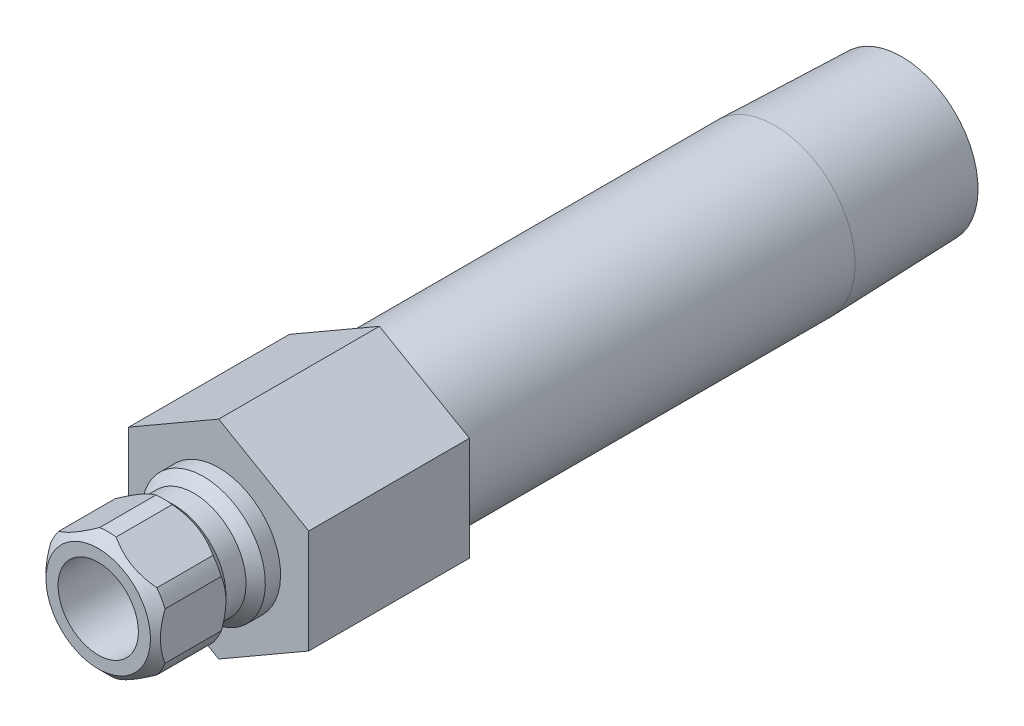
from build123d import *

# Parameters (mm, degrees)
SKETCH2_R           = 3.175
BOSS_EXTRUDE1_DEPTH = 12.7
CUT_EXTRUDE1_START  = 3.556
SKETCH3_OUTSIDE_W   = 29.646
SKETCH3_OUTSIDE_H   = 31.846
CUT_EXTRUDE1_DEPTH  = 52.501441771


with BuildPart() as part:
    # Sketch1 → Revolve1 (revolve)
    with BuildSketch(Plane(origin=(0, 0, 0), x_dir=(0, 0, -1), z_dir=(1, 0, 0))):
        Polygon((-9.525, 3.175), (-9.525, 4.1275), (-8.763, 4.8895), (-4.318, 4.8895), (-3.556, 4.1275), (-1.9685, 4.1275), (-1.2065, 4.8895), (0, 4.8895), (0, 6.35), (43.942, 6.35), (53.975, 6.036470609), (53.975, 4.6228), (12.7, 4.6228), (12.7, 3.175), align=None)
    revolve(axis=Axis((0, 0, 0), (0, 0, 1)))

    # Sketch2 → Boss-Extrude1 (add)
    with BuildSketch(Plane.XY):
        Polygon((-7.112, 4.106115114), (-7.112, -4.106115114), (0, -8.212230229), (7.112, -4.106115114), (7.112, 4.106115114), (0, 8.212230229), align=None)
        with Locations(Location((0, 0, 0), (0, 0, 90))):
            Circle(SKETCH2_R, mode=Mode.SUBTRACT)
    extrude(amount=-BOSS_EXTRUDE1_DEPTH)

    # Sketch3 outside → Cut-Extrude1 (cut, through all)
    with BuildSketch(Plane.XY.offset(CUT_EXTRUDE1_START)):
        Rectangle(SKETCH3_OUTSIDE_W, SKETCH3_OUTSIDE_H)
        Polygon((4.5212, -2.610316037), (4.5212, 2.610316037), (0, 5.220632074), (-4.5212, 2.610316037), (-4.5212, -2.610316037), (0, -5.220632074), align=None, mode=Mode.SUBTRACT)
    extrude(amount=CUT_EXTRUDE1_DEPTH, mode=Mode.SUBTRACT)


solid = part.part
